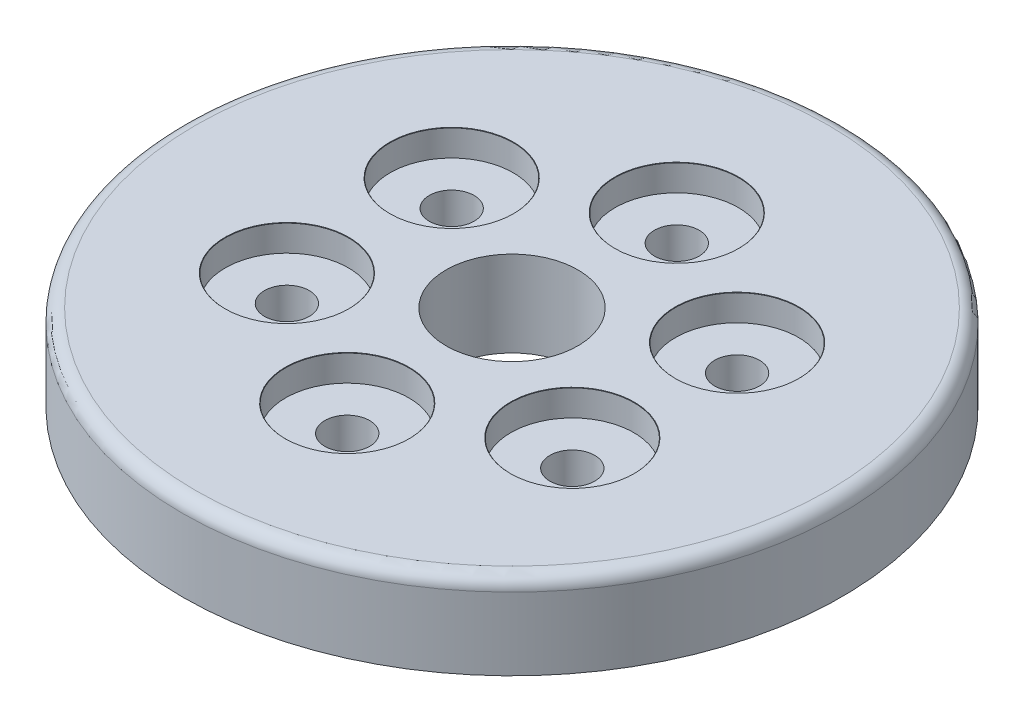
ISO-10303-21;
HEADER;
FILE_DESCRIPTION(('STEP AP214'),'2;1');
FILE_NAME('part.step','',(''),(''),'','','');
FILE_SCHEMA(('AUTOMOTIVE_DESIGN { 1 0 10303 214 1 1 1 1 }'));
ENDSEC;
DATA;
#1=APPLICATION_CONTEXT('core data for automotive mechanical design processes');
#2=APPLICATION_PROTOCOL_DEFINITION('international standard','automotive_design',2000,#1);
#3=PRODUCT_CONTEXT('',#1,'mechanical');
#4=PRODUCT('Part','Part','',(#3));
#5=PRODUCT_RELATED_PRODUCT_CATEGORY('part','',(#4));
#6=PRODUCT_DEFINITION_FORMATION('','',#4);
#7=PRODUCT_DEFINITION_CONTEXT('part definition',#1,'design');
#8=PRODUCT_DEFINITION('design','',#6,#7);
#9=PRODUCT_DEFINITION_SHAPE('','',#8);
#10=(LENGTH_UNIT() NAMED_UNIT(*) SI_UNIT(.MILLI.,.METRE.));
#11=(NAMED_UNIT(*) PLANE_ANGLE_UNIT() SI_UNIT($,.RADIAN.));
#12=(NAMED_UNIT(*) SI_UNIT($,.STERADIAN.) SOLID_ANGLE_UNIT());
#13=UNCERTAINTY_MEASURE_WITH_UNIT(LENGTH_MEASURE(1.E-05),#10,'distance_accuracy_value','');
#14=(GEOMETRIC_REPRESENTATION_CONTEXT(3) GLOBAL_UNCERTAINTY_ASSIGNED_CONTEXT((#13)) GLOBAL_UNIT_ASSIGNED_CONTEXT((#10,
#11,#12)) REPRESENTATION_CONTEXT('',''));
#15=CARTESIAN_POINT('',(0.,0.,0.));
#16=DIRECTION('',(0.,0.,1.));
#17=DIRECTION('',(1.,0.,0.));
#18=AXIS2_PLACEMENT_3D('',#15,#16,#17);
#19=CARTESIAN_POINT('',(0.,6.5,0.));
#20=DIRECTION('',(0.,-1.,0.));
#21=DIRECTION('',(0.,0.,-1.));
#22=AXIS2_PLACEMENT_3D('',#19,#20,#21);
#23=CYLINDRICAL_SURFACE('',#22,25.);
#24=CARTESIAN_POINT('',(0.,5.5,0.));
#25=DIRECTION('',(0.,1.,0.));
#26=DIRECTION('',(0.,0.,1.));
#27=AXIS2_PLACEMENT_3D('',#24,#25,#26);
#28=CIRCLE('',#27,25.);
#29=CARTESIAN_POINT('',(0.,5.5,-25.));
#30=VERTEX_POINT('',#29);
#31=EDGE_CURVE('E10',#30,#30,#28,.F.);
#32=CARTESIAN_POINT('',(0.,0.,0.));
#33=DIRECTION('',(0.,1.,0.));
#34=DIRECTION('',(0.,0.,1.));
#35=AXIS2_PLACEMENT_3D('',#32,#33,#34);
#36=CIRCLE('',#35,25.);
#37=CARTESIAN_POINT('',(0.,0.,-25.));
#38=VERTEX_POINT('',#37);
#39=EDGE_CURVE('E59',#38,#38,#36,.T.);
#40=CARTESIAN_POINT('',(0.,5.5,-25.));
#41=CARTESIAN_POINT('',(0.,5.44270833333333,-25.));
#42=CARTESIAN_POINT('',(0.,5.38541666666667,-25.));
#43=CARTESIAN_POINT('',(0.,5.27083333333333,-25.));
#44=CARTESIAN_POINT('',(0.,5.21354166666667,-25.));
#45=CARTESIAN_POINT('',(0.,5.09895833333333,-25.));
#46=CARTESIAN_POINT('',(0.,5.04166666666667,-25.));
#47=CARTESIAN_POINT('',(0.,4.92708333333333,-25.));
#48=CARTESIAN_POINT('',(0.,4.86979166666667,-25.));
#49=CARTESIAN_POINT('',(0.,4.75520833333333,-25.));
#50=CARTESIAN_POINT('',(0.,4.69791666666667,-25.));
#51=CARTESIAN_POINT('',(0.,4.58333333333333,-25.));
#52=CARTESIAN_POINT('',(0.,4.52604166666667,-25.));
#53=CARTESIAN_POINT('',(0.,4.41145833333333,-25.));
#54=CARTESIAN_POINT('',(0.,4.35416666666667,-25.));
#55=CARTESIAN_POINT('',(0.,4.23958333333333,-25.));
#56=CARTESIAN_POINT('',(0.,4.18229166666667,-25.));
#57=CARTESIAN_POINT('',(0.,4.06770833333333,-25.));
#58=CARTESIAN_POINT('',(0.,4.01041666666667,-25.));
#59=CARTESIAN_POINT('',(0.,3.89583333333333,-25.));
#60=CARTESIAN_POINT('',(0.,3.83854166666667,-25.));
#61=CARTESIAN_POINT('',(0.,3.72395833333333,-25.));
#62=CARTESIAN_POINT('',(0.,3.66666666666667,-25.));
#63=CARTESIAN_POINT('',(0.,3.55208333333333,-25.));
#64=CARTESIAN_POINT('',(0.,3.49479166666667,-25.));
#65=CARTESIAN_POINT('',(0.,3.38020833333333,-25.));
#66=CARTESIAN_POINT('',(0.,3.32291666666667,-25.));
#67=CARTESIAN_POINT('',(0.,3.20833333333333,-25.));
#68=CARTESIAN_POINT('',(0.,3.15104166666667,-25.));
#69=CARTESIAN_POINT('',(0.,3.03645833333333,-25.));
#70=CARTESIAN_POINT('',(0.,2.97916666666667,-25.));
#71=CARTESIAN_POINT('',(0.,2.86458333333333,-25.));
#72=CARTESIAN_POINT('',(0.,2.80729166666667,-25.));
#73=CARTESIAN_POINT('',(0.,2.69270833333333,-25.));
#74=CARTESIAN_POINT('',(0.,2.63541666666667,-25.));
#75=CARTESIAN_POINT('',(0.,2.52083333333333,-25.));
#76=CARTESIAN_POINT('',(0.,2.46354166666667,-25.));
#77=CARTESIAN_POINT('',(0.,2.34895833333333,-25.));
#78=CARTESIAN_POINT('',(0.,2.29166666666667,-25.));
#79=CARTESIAN_POINT('',(0.,2.17708333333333,-25.));
#80=CARTESIAN_POINT('',(0.,2.11979166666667,-25.));
#81=CARTESIAN_POINT('',(0.,2.00520833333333,-25.));
#82=CARTESIAN_POINT('',(0.,1.94791666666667,-25.));
#83=CARTESIAN_POINT('',(0.,1.83333333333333,-25.));
#84=CARTESIAN_POINT('',(0.,1.77604166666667,-25.));
#85=CARTESIAN_POINT('',(0.,1.66145833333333,-25.));
#86=CARTESIAN_POINT('',(0.,1.60416666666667,-25.));
#87=CARTESIAN_POINT('',(0.,1.48958333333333,-25.));
#88=CARTESIAN_POINT('',(0.,1.43229166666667,-25.));
#89=CARTESIAN_POINT('',(0.,1.31770833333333,-25.));
#90=CARTESIAN_POINT('',(0.,1.26041666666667,-25.));
#91=CARTESIAN_POINT('',(0.,1.14583333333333,-25.));
#92=CARTESIAN_POINT('',(0.,1.08854166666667,-25.));
#93=CARTESIAN_POINT('',(0.,0.973958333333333,-25.));
#94=CARTESIAN_POINT('',(0.,0.916666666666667,-25.));
#95=CARTESIAN_POINT('',(0.,0.802083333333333,-25.));
#96=CARTESIAN_POINT('',(0.,0.744791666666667,-25.));
#97=CARTESIAN_POINT('',(0.,0.630208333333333,-25.));
#98=CARTESIAN_POINT('',(0.,0.572916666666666,-25.));
#99=CARTESIAN_POINT('',(0.,0.458333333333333,-25.));
#100=CARTESIAN_POINT('',(0.,0.401041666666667,-25.));
#101=CARTESIAN_POINT('',(0.,0.286458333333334,-25.));
#102=CARTESIAN_POINT('',(0.,0.229166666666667,-25.));
#103=CARTESIAN_POINT('',(0.,0.114583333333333,-25.));
#104=CARTESIAN_POINT('',(0.,0.0572916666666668,-25.));
#105=CARTESIAN_POINT('',(0.,0.,-25.));
#106=B_SPLINE_CURVE_WITH_KNOTS('',3,(#40,#41,#42,#43,#44,#45,#46,#47,#48,#49,#50,#51,#52,#53,
#54,#55,#56,#57,#58,#59,#60,#61,#62,#63,#64,#65,#66,#67,#68,#69,#70,#71,#72,#73,#74,#75,#76,#77,
#78,#79,#80,#81,#82,#83,#84,#85,#86,#87,#88,#89,#90,#91,#92,#93,#94,#95,#96,#97,#98,#99,#100,
#101,#102,#103,#104,#105),.UNSPECIFIED.,.F.,.F.,(4,2,2,2,2,2,2,2,2,2,2,2,2,2,2,2,2,2,2,2,2,2,2,
2,2,2,2,2,2,2,2,2,4),(0.,0.171874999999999,0.343749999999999,0.515625,0.6875,0.859375,1.03125,
1.203125,1.375,1.546875,1.71875,1.890625,2.0625,2.234375,2.40625,2.578125,2.75,2.921875,3.09375,
3.265625,3.4375,3.609375,3.78125,3.953125,4.125,4.296875,4.46875,4.640625,4.8125,4.984375,
5.15625,5.328125,5.5),.UNSPECIFIED.);
#107=EDGE_CURVE('BSEAM45',#30,#38,#106,.T.);
#108=ORIENTED_EDGE('',*,*,#31,.T.);
#109=ORIENTED_EDGE('',*,*,#39,.T.);
#110=ORIENTED_EDGE('',*,*,#107,.T.);
#111=ORIENTED_EDGE('',*,*,#107,.F.);
#112=EDGE_LOOP('',(#108,#110,#109,#111));
#113=FACE_BOUND('',#112,.T.);
#114=ADVANCED_FACE('F45',(#113),#23,.T.);
#115=CARTESIAN_POINT('',(0.,6.5,0.));
#116=DIRECTION('',(0.,1.,0.));
#117=DIRECTION('',(0.,0.,1.));
#118=AXIS2_PLACEMENT_3D('',#115,#116,#117);
#119=PLANE('',#118);
#120=CARTESIAN_POINT('',(0.,6.5,0.));
#121=DIRECTION('',(0.,1.,0.));
#122=DIRECTION('',(0.,0.,1.));
#123=AXIS2_PLACEMENT_3D('',#120,#121,#122);
#124=CIRCLE('',#123,5.);
#125=CARTESIAN_POINT('',(0.,6.5,5.));
#126=VERTEX_POINT('',#125);
#127=EDGE_CURVE('E185',#126,#126,#124,.T.);
#128=ORIENTED_EDGE('',*,*,#127,.F.);
#129=EDGE_LOOP('',(#128));
#130=FACE_BOUND('',#129,.T.);
#131=CARTESIAN_POINT('',(0.,6.5,0.));
#132=DIRECTION('',(0.,1.,0.));
#133=DIRECTION('',(0.,0.,1.));
#134=AXIS2_PLACEMENT_3D('',#131,#132,#133);
#135=CIRCLE('',#134,24.);
#136=CARTESIAN_POINT('',(0.,6.5,24.));
#137=VERTEX_POINT('',#136);
#138=EDGE_CURVE('E54',#137,#137,#135,.T.);
#139=ORIENTED_EDGE('',*,*,#138,.T.);
#140=EDGE_LOOP('',(#139));
#141=FACE_BOUND('',#140,.T.);
#142=CARTESIAN_POINT('',(0.,6.5,-12.5));
#143=DIRECTION('',(0.,1.,0.));
#144=DIRECTION('',(0.,0.,1.));
#145=AXIS2_PLACEMENT_3D('',#142,#143,#144);
#146=CIRCLE('',#145,4.7005);
#147=CARTESIAN_POINT('',(0.,6.5,-7.7995));
#148=VERTEX_POINT('',#147);
#149=EDGE_CURVE('E181',#148,#148,#146,.T.);
#150=ORIENTED_EDGE('',*,*,#149,.F.);
#151=EDGE_LOOP('',(#150));
#152=FACE_BOUND('',#151,.T.);
#153=CARTESIAN_POINT('',(10.8253175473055,6.5,-6.24999999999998));
#154=DIRECTION('',(0.,1.,0.));
#155=DIRECTION('',(0.,0.,1.));
#156=AXIS2_PLACEMENT_3D('',#153,#154,#155);
#157=CIRCLE('',#156,4.7005);
#158=CARTESIAN_POINT('',(10.8253175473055,6.5,-1.54949999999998));
#159=VERTEX_POINT('',#158);
#160=EDGE_CURVE('E161',#159,#159,#157,.T.);
#161=ORIENTED_EDGE('',*,*,#160,.F.);
#162=EDGE_LOOP('',(#161));
#163=FACE_BOUND('',#162,.T.);
#164=CARTESIAN_POINT('',(10.8253175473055,6.5,6.25000000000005));
#165=DIRECTION('',(0.,1.,0.));
#166=DIRECTION('',(0.,0.,1.));
#167=AXIS2_PLACEMENT_3D('',#164,#165,#166);
#168=CIRCLE('',#167,4.7005);
#169=CARTESIAN_POINT('',(10.8253175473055,6.5,10.9505000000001));
#170=VERTEX_POINT('',#169);
#171=EDGE_CURVE('E141',#170,#170,#168,.T.);
#172=ORIENTED_EDGE('',*,*,#171,.F.);
#173=EDGE_LOOP('',(#172));
#174=FACE_BOUND('',#173,.T.);
#175=CARTESIAN_POINT('',(0.,6.5,12.5));
#176=DIRECTION('',(0.,1.,0.));
#177=DIRECTION('',(0.,0.,1.));
#178=AXIS2_PLACEMENT_3D('',#175,#176,#177);
#179=CIRCLE('',#178,4.7005);
#180=CARTESIAN_POINT('',(0.,6.5,17.2005));
#181=VERTEX_POINT('',#180);
#182=EDGE_CURVE('E121',#181,#181,#179,.T.);
#183=ORIENTED_EDGE('',*,*,#182,.F.);
#184=EDGE_LOOP('',(#183));
#185=FACE_BOUND('',#184,.T.);
#186=CARTESIAN_POINT('',(-10.8253175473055,6.5,6.2499999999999));
#187=DIRECTION('',(0.,1.,0.));
#188=DIRECTION('',(0.,0.,1.));
#189=AXIS2_PLACEMENT_3D('',#186,#187,#188);
#190=CIRCLE('',#189,4.7005);
#191=CARTESIAN_POINT('',(-10.8253175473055,6.5,10.9504999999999));
#192=VERTEX_POINT('',#191);
#193=EDGE_CURVE('E101',#192,#192,#190,.T.);
#194=ORIENTED_EDGE('',*,*,#193,.F.);
#195=EDGE_LOOP('',(#194));
#196=FACE_BOUND('',#195,.T.);
#197=CARTESIAN_POINT('',(-10.8253175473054,6.5,-6.25000000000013));
#198=DIRECTION('',(0.,1.,0.));
#199=DIRECTION('',(0.,0.,1.));
#200=AXIS2_PLACEMENT_3D('',#197,#198,#199);
#201=CIRCLE('',#200,4.7005);
#202=CARTESIAN_POINT('',(-10.8253175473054,6.5,-1.54950000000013));
#203=VERTEX_POINT('',#202);
#204=EDGE_CURVE('E81',#203,#203,#201,.T.);
#205=ORIENTED_EDGE('',*,*,#204,.F.);
#206=EDGE_LOOP('',(#205));
#207=FACE_BOUND('',#206,.T.);
#208=ADVANCED_FACE('F208',(#130,#141,#152,#163,#174,#185,#196,#207),#119,.T.);
#209=CARTESIAN_POINT('',(0.,0.,0.));
#210=DIRECTION('',(0.,1.,0.));
#211=DIRECTION('',(0.,0.,1.));
#212=AXIS2_PLACEMENT_3D('',#209,#210,#211);
#213=PLANE('',#212);
#214=CARTESIAN_POINT('',(0.,0.,0.));
#215=DIRECTION('',(0.,1.,0.));
#216=DIRECTION('',(0.,0.,1.));
#217=AXIS2_PLACEMENT_3D('',#214,#215,#216);
#218=CIRCLE('',#217,5.);
#219=CARTESIAN_POINT('',(0.,0.,5.));
#220=VERTEX_POINT('',#219);
#221=EDGE_CURVE('E49',#220,#220,#218,.T.);
#222=ORIENTED_EDGE('',*,*,#221,.T.);
#223=EDGE_LOOP('',(#222));
#224=FACE_BOUND('',#223,.T.);
#225=CARTESIAN_POINT('',(0.,0.,-12.5));
#226=DIRECTION('',(0.,1.,0.));
#227=DIRECTION('',(0.,0.,1.));
#228=AXIS2_PLACEMENT_3D('',#225,#226,#227);
#229=CIRCLE('',#228,1.7);
#230=CARTESIAN_POINT('',(0.,0.,-10.8));
#231=VERTEX_POINT('',#230);
#232=EDGE_CURVE('E165',#231,#231,#229,.T.);
#233=ORIENTED_EDGE('',*,*,#232,.T.);
#234=EDGE_LOOP('',(#233));
#235=FACE_BOUND('',#234,.T.);
#236=CARTESIAN_POINT('',(10.8253175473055,0.,-6.24999999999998));
#237=DIRECTION('',(0.,1.,0.));
#238=DIRECTION('',(0.,0.,1.));
#239=AXIS2_PLACEMENT_3D('',#236,#237,#238);
#240=CIRCLE('',#239,1.7);
#241=CARTESIAN_POINT('',(10.8253175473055,0.,-4.54999999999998));
#242=VERTEX_POINT('',#241);
#243=EDGE_CURVE('E145',#242,#242,#240,.T.);
#244=ORIENTED_EDGE('',*,*,#243,.T.);
#245=EDGE_LOOP('',(#244));
#246=FACE_BOUND('',#245,.T.);
#247=CARTESIAN_POINT('',(10.8253175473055,0.,6.25000000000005));
#248=DIRECTION('',(0.,1.,0.));
#249=DIRECTION('',(0.,0.,1.));
#250=AXIS2_PLACEMENT_3D('',#247,#248,#249);
#251=CIRCLE('',#250,1.7);
#252=CARTESIAN_POINT('',(10.8253175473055,0.,7.95000000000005));
#253=VERTEX_POINT('',#252);
#254=EDGE_CURVE('E125',#253,#253,#251,.T.);
#255=ORIENTED_EDGE('',*,*,#254,.T.);
#256=EDGE_LOOP('',(#255));
#257=FACE_BOUND('',#256,.T.);
#258=CARTESIAN_POINT('',(0.,0.,12.5));
#259=DIRECTION('',(0.,1.,0.));
#260=DIRECTION('',(0.,0.,1.));
#261=AXIS2_PLACEMENT_3D('',#258,#259,#260);
#262=CIRCLE('',#261,1.7);
#263=CARTESIAN_POINT('',(0.,0.,14.2));
#264=VERTEX_POINT('',#263);
#265=EDGE_CURVE('E105',#264,#264,#262,.T.);
#266=ORIENTED_EDGE('',*,*,#265,.T.);
#267=EDGE_LOOP('',(#266));
#268=FACE_BOUND('',#267,.T.);
#269=CARTESIAN_POINT('',(-10.8253175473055,0.,6.2499999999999));
#270=DIRECTION('',(0.,1.,0.));
#271=DIRECTION('',(0.,0.,1.));
#272=AXIS2_PLACEMENT_3D('',#269,#270,#271);
#273=CIRCLE('',#272,1.7);
#274=CARTESIAN_POINT('',(-10.8253175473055,0.,7.9499999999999));
#275=VERTEX_POINT('',#274);
#276=EDGE_CURVE('E85',#275,#275,#273,.T.);
#277=ORIENTED_EDGE('',*,*,#276,.T.);
#278=EDGE_LOOP('',(#277));
#279=FACE_BOUND('',#278,.T.);
#280=CARTESIAN_POINT('',(-10.8253175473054,0.,-6.25000000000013));
#281=DIRECTION('',(0.,1.,0.));
#282=DIRECTION('',(0.,0.,1.));
#283=AXIS2_PLACEMENT_3D('',#280,#281,#282);
#284=CIRCLE('',#283,1.7);
#285=CARTESIAN_POINT('',(-10.8253175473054,0.,-4.55000000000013));
#286=VERTEX_POINT('',#285);
#287=EDGE_CURVE('E65',#286,#286,#284,.T.);
#288=ORIENTED_EDGE('',*,*,#287,.T.);
#289=EDGE_LOOP('',(#288));
#290=FACE_BOUND('',#289,.T.);
#291=ORIENTED_EDGE('',*,*,#39,.F.);
#292=EDGE_LOOP('',(#291));
#293=FACE_BOUND('',#292,.T.);
#294=ADVANCED_FACE('F194',(#224,#235,#246,#257,#268,#279,#290,#293),#213,.F.);
#295=CARTESIAN_POINT('',(-10.8253175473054,6.5,-6.25000000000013));
#296=DIRECTION('',(0.,1.,0.));
#297=DIRECTION('',(0.,0.,1.));
#298=AXIS2_PLACEMENT_3D('',#295,#296,#297);
#299=CYLINDRICAL_SURFACE('',#298,1.7);
#300=ORIENTED_EDGE('',*,*,#287,.F.);
#301=EDGE_LOOP('',(#300));
#302=FACE_BOUND('',#301,.T.);
#303=CARTESIAN_POINT('',(-10.8253175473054,4.5,-6.25000000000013));
#304=DIRECTION('',(0.,1.,0.));
#305=DIRECTION('',(0.,0.,1.));
#306=AXIS2_PLACEMENT_3D('',#303,#304,#305);
#307=CIRCLE('',#306,1.7);
#308=CARTESIAN_POINT('',(-10.8253175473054,4.5,-4.55000000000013));
#309=VERTEX_POINT('',#308);
#310=EDGE_CURVE('E69',#309,#309,#307,.T.);
#311=ORIENTED_EDGE('',*,*,#310,.T.);
#312=EDGE_LOOP('',(#311));
#313=FACE_BOUND('',#312,.T.);
#314=ADVANCED_FACE('F217',(#302,#313),#299,.F.);
#315=CARTESIAN_POINT('',(-6.14981754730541,4.5,-6.25000000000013));
#316=DIRECTION('',(0.,-1.,0.));
#317=DIRECTION('',(0.,0.,-1.));
#318=AXIS2_PLACEMENT_3D('',#315,#316,#317);
#319=PLANE('',#318);
#320=ORIENTED_EDGE('',*,*,#310,.F.);
#321=EDGE_LOOP('',(#320));
#322=FACE_BOUND('',#321,.T.);
#323=CARTESIAN_POINT('',(-10.8253175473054,4.5,-6.25000000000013));
#324=DIRECTION('',(0.,1.,0.));
#325=DIRECTION('',(0.,0.,1.));
#326=AXIS2_PLACEMENT_3D('',#323,#324,#325);
#327=CIRCLE('',#326,4.6755);
#328=CARTESIAN_POINT('',(-10.8253175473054,4.5,-1.57450000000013));
#329=VERTEX_POINT('',#328);
#330=EDGE_CURVE('E73',#329,#329,#327,.T.);
#331=ORIENTED_EDGE('',*,*,#330,.T.);
#332=EDGE_LOOP('',(#331));
#333=FACE_BOUND('',#332,.T.);
#334=ADVANCED_FACE('F221',(#322,#333),#319,.F.);
#335=CARTESIAN_POINT('',(-10.8253175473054,6.5,-6.25000000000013));
#336=DIRECTION('',(0.,1.,0.));
#337=DIRECTION('',(0.,0.,1.));
#338=AXIS2_PLACEMENT_3D('',#335,#336,#337);
#339=CYLINDRICAL_SURFACE('',#338,4.6755);
#340=ORIENTED_EDGE('',*,*,#330,.F.);
#341=EDGE_LOOP('',(#340));
#342=FACE_BOUND('',#341,.T.);
#343=CARTESIAN_POINT('',(-10.8253175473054,6.475,-6.25000000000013));
#344=DIRECTION('',(0.,1.,0.));
#345=DIRECTION('',(0.,0.,1.));
#346=AXIS2_PLACEMENT_3D('',#343,#344,#345);
#347=CIRCLE('',#346,4.6755);
#348=CARTESIAN_POINT('',(-10.8253175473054,6.475,-1.57450000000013));
#349=VERTEX_POINT('',#348);
#350=EDGE_CURVE('E77',#349,#349,#347,.T.);
#351=ORIENTED_EDGE('',*,*,#350,.T.);
#352=EDGE_LOOP('',(#351));
#353=FACE_BOUND('',#352,.T.);
#354=ADVANCED_FACE('F225',(#342,#353),#339,.F.);
#355=CARTESIAN_POINT('',(-10.8253175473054,6.5,-6.25000000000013));
#356=DIRECTION('',(0.,1.,0.));
#357=DIRECTION('',(0.,0.,1.));
#358=AXIS2_PLACEMENT_3D('',#355,#356,#357);
#359=CONICAL_SURFACE('',#358,4.7005,0.785398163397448);
#360=ORIENTED_EDGE('',*,*,#350,.F.);
#361=EDGE_LOOP('',(#360));
#362=FACE_BOUND('',#361,.T.);
#363=ORIENTED_EDGE('',*,*,#204,.T.);
#364=EDGE_LOOP('',(#363));
#365=FACE_BOUND('',#364,.T.);
#366=ADVANCED_FACE('F229',(#362,#365),#359,.F.);
#367=CARTESIAN_POINT('',(-10.8253175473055,6.5,6.2499999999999));
#368=DIRECTION('',(0.,1.,0.));
#369=DIRECTION('',(0.,0.,1.));
#370=AXIS2_PLACEMENT_3D('',#367,#368,#369);
#371=CYLINDRICAL_SURFACE('',#370,1.7);
#372=ORIENTED_EDGE('',*,*,#276,.F.);
#373=EDGE_LOOP('',(#372));
#374=FACE_BOUND('',#373,.T.);
#375=CARTESIAN_POINT('',(-10.8253175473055,4.5,6.2499999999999));
#376=DIRECTION('',(0.,1.,0.));
#377=DIRECTION('',(0.,0.,1.));
#378=AXIS2_PLACEMENT_3D('',#375,#376,#377);
#379=CIRCLE('',#378,1.7);
#380=CARTESIAN_POINT('',(-10.8253175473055,4.5,7.9499999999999));
#381=VERTEX_POINT('',#380);
#382=EDGE_CURVE('E89',#381,#381,#379,.T.);
#383=ORIENTED_EDGE('',*,*,#382,.T.);
#384=EDGE_LOOP('',(#383));
#385=FACE_BOUND('',#384,.T.);
#386=ADVANCED_FACE('F233',(#374,#385),#371,.F.);
#387=CARTESIAN_POINT('',(-6.14981754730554,4.5,6.2499999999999));
#388=DIRECTION('',(0.,-1.,0.));
#389=DIRECTION('',(0.,0.,-1.));
#390=AXIS2_PLACEMENT_3D('',#387,#388,#389);
#391=PLANE('',#390);
#392=ORIENTED_EDGE('',*,*,#382,.F.);
#393=EDGE_LOOP('',(#392));
#394=FACE_BOUND('',#393,.T.);
#395=CARTESIAN_POINT('',(-10.8253175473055,4.5,6.2499999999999));
#396=DIRECTION('',(0.,1.,0.));
#397=DIRECTION('',(0.,0.,1.));
#398=AXIS2_PLACEMENT_3D('',#395,#396,#397);
#399=CIRCLE('',#398,4.6755);
#400=CARTESIAN_POINT('',(-10.8253175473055,4.5,10.9254999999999));
#401=VERTEX_POINT('',#400);
#402=EDGE_CURVE('E93',#401,#401,#399,.T.);
#403=ORIENTED_EDGE('',*,*,#402,.T.);
#404=EDGE_LOOP('',(#403));
#405=FACE_BOUND('',#404,.T.);
#406=ADVANCED_FACE('F237',(#394,#405),#391,.F.);
#407=CARTESIAN_POINT('',(-10.8253175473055,6.5,6.2499999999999));
#408=DIRECTION('',(0.,1.,0.));
#409=DIRECTION('',(0.,0.,1.));
#410=AXIS2_PLACEMENT_3D('',#407,#408,#409);
#411=CYLINDRICAL_SURFACE('',#410,4.6755);
#412=ORIENTED_EDGE('',*,*,#402,.F.);
#413=EDGE_LOOP('',(#412));
#414=FACE_BOUND('',#413,.T.);
#415=CARTESIAN_POINT('',(-10.8253175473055,6.475,6.2499999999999));
#416=DIRECTION('',(0.,1.,0.));
#417=DIRECTION('',(0.,0.,1.));
#418=AXIS2_PLACEMENT_3D('',#415,#416,#417);
#419=CIRCLE('',#418,4.6755);
#420=CARTESIAN_POINT('',(-10.8253175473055,6.475,10.9254999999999));
#421=VERTEX_POINT('',#420);
#422=EDGE_CURVE('E97',#421,#421,#419,.T.);
#423=ORIENTED_EDGE('',*,*,#422,.T.);
#424=EDGE_LOOP('',(#423));
#425=FACE_BOUND('',#424,.T.);
#426=ADVANCED_FACE('F241',(#414,#425),#411,.F.);
#427=CARTESIAN_POINT('',(-10.8253175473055,6.5,6.2499999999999));
#428=DIRECTION('',(0.,1.,0.));
#429=DIRECTION('',(0.,0.,1.));
#430=AXIS2_PLACEMENT_3D('',#427,#428,#429);
#431=CONICAL_SURFACE('',#430,4.7005,0.785398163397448);
#432=ORIENTED_EDGE('',*,*,#422,.F.);
#433=EDGE_LOOP('',(#432));
#434=FACE_BOUND('',#433,.T.);
#435=ORIENTED_EDGE('',*,*,#193,.T.);
#436=EDGE_LOOP('',(#435));
#437=FACE_BOUND('',#436,.T.);
#438=ADVANCED_FACE('F245',(#434,#437),#431,.F.);
#439=CARTESIAN_POINT('',(0.,6.5,12.5));
#440=DIRECTION('',(0.,1.,0.));
#441=DIRECTION('',(0.,0.,1.));
#442=AXIS2_PLACEMENT_3D('',#439,#440,#441);
#443=CYLINDRICAL_SURFACE('',#442,1.7);
#444=ORIENTED_EDGE('',*,*,#265,.F.);
#445=EDGE_LOOP('',(#444));
#446=FACE_BOUND('',#445,.T.);
#447=CARTESIAN_POINT('',(0.,4.5,12.5));
#448=DIRECTION('',(0.,1.,0.));
#449=DIRECTION('',(0.,0.,1.));
#450=AXIS2_PLACEMENT_3D('',#447,#448,#449);
#451=CIRCLE('',#450,1.7);
#452=CARTESIAN_POINT('',(0.,4.5,14.2));
#453=VERTEX_POINT('',#452);
#454=EDGE_CURVE('E109',#453,#453,#451,.T.);
#455=ORIENTED_EDGE('',*,*,#454,.T.);
#456=EDGE_LOOP('',(#455));
#457=FACE_BOUND('',#456,.T.);
#458=ADVANCED_FACE('F249',(#446,#457),#443,.F.);
#459=CARTESIAN_POINT('',(4.67549999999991,4.5,12.5));
#460=DIRECTION('',(0.,-1.,0.));
#461=DIRECTION('',(0.,0.,-1.));
#462=AXIS2_PLACEMENT_3D('',#459,#460,#461);
#463=PLANE('',#462);
#464=ORIENTED_EDGE('',*,*,#454,.F.);
#465=EDGE_LOOP('',(#464));
#466=FACE_BOUND('',#465,.T.);
#467=CARTESIAN_POINT('',(0.,4.5,12.5));
#468=DIRECTION('',(0.,1.,0.));
#469=DIRECTION('',(0.,0.,1.));
#470=AXIS2_PLACEMENT_3D('',#467,#468,#469);
#471=CIRCLE('',#470,4.6755);
#472=CARTESIAN_POINT('',(0.,4.5,17.1755));
#473=VERTEX_POINT('',#472);
#474=EDGE_CURVE('E113',#473,#473,#471,.T.);
#475=ORIENTED_EDGE('',*,*,#474,.T.);
#476=EDGE_LOOP('',(#475));
#477=FACE_BOUND('',#476,.T.);
#478=ADVANCED_FACE('F253',(#466,#477),#463,.F.);
#479=CARTESIAN_POINT('',(0.,6.5,12.5));
#480=DIRECTION('',(0.,1.,0.));
#481=DIRECTION('',(0.,0.,1.));
#482=AXIS2_PLACEMENT_3D('',#479,#480,#481);
#483=CYLINDRICAL_SURFACE('',#482,4.6755);
#484=ORIENTED_EDGE('',*,*,#474,.F.);
#485=EDGE_LOOP('',(#484));
#486=FACE_BOUND('',#485,.T.);
#487=CARTESIAN_POINT('',(0.,6.475,12.5));
#488=DIRECTION('',(0.,1.,0.));
#489=DIRECTION('',(0.,0.,1.));
#490=AXIS2_PLACEMENT_3D('',#487,#488,#489);
#491=CIRCLE('',#490,4.6755);
#492=CARTESIAN_POINT('',(0.,6.475,17.1755));
#493=VERTEX_POINT('',#492);
#494=EDGE_CURVE('E117',#493,#493,#491,.T.);
#495=ORIENTED_EDGE('',*,*,#494,.T.);
#496=EDGE_LOOP('',(#495));
#497=FACE_BOUND('',#496,.T.);
#498=ADVANCED_FACE('F257',(#486,#497),#483,.F.);
#499=CARTESIAN_POINT('',(0.,6.5,12.5));
#500=DIRECTION('',(0.,1.,0.));
#501=DIRECTION('',(0.,0.,1.));
#502=AXIS2_PLACEMENT_3D('',#499,#500,#501);
#503=CONICAL_SURFACE('',#502,4.7005,0.785398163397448);
#504=ORIENTED_EDGE('',*,*,#494,.F.);
#505=EDGE_LOOP('',(#504));
#506=FACE_BOUND('',#505,.T.);
#507=ORIENTED_EDGE('',*,*,#182,.T.);
#508=EDGE_LOOP('',(#507));
#509=FACE_BOUND('',#508,.T.);
#510=ADVANCED_FACE('F261',(#506,#509),#503,.F.);
#511=CARTESIAN_POINT('',(10.8253175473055,6.5,6.25000000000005));
#512=DIRECTION('',(0.,1.,0.));
#513=DIRECTION('',(0.,0.,1.));
#514=AXIS2_PLACEMENT_3D('',#511,#512,#513);
#515=CYLINDRICAL_SURFACE('',#514,1.7);
#516=ORIENTED_EDGE('',*,*,#254,.F.);
#517=EDGE_LOOP('',(#516));
#518=FACE_BOUND('',#517,.T.);
#519=CARTESIAN_POINT('',(10.8253175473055,4.5,6.25000000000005));
#520=DIRECTION('',(0.,1.,0.));
#521=DIRECTION('',(0.,0.,1.));
#522=AXIS2_PLACEMENT_3D('',#519,#520,#521);
#523=CIRCLE('',#522,1.7);
#524=CARTESIAN_POINT('',(10.8253175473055,4.5,7.95000000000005));
#525=VERTEX_POINT('',#524);
#526=EDGE_CURVE('E129',#525,#525,#523,.T.);
#527=ORIENTED_EDGE('',*,*,#526,.T.);
#528=EDGE_LOOP('',(#527));
#529=FACE_BOUND('',#528,.T.);
#530=ADVANCED_FACE('F265',(#518,#529),#515,.F.);
#531=CARTESIAN_POINT('',(15.5008175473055,4.5,6.25000000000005));
#532=DIRECTION('',(0.,-1.,0.));
#533=DIRECTION('',(0.,0.,-1.));
#534=AXIS2_PLACEMENT_3D('',#531,#532,#533);
#535=PLANE('',#534);
#536=ORIENTED_EDGE('',*,*,#526,.F.);
#537=EDGE_LOOP('',(#536));
#538=FACE_BOUND('',#537,.T.);
#539=CARTESIAN_POINT('',(10.8253175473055,4.5,6.25000000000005));
#540=DIRECTION('',(0.,1.,0.));
#541=DIRECTION('',(0.,0.,1.));
#542=AXIS2_PLACEMENT_3D('',#539,#540,#541);
#543=CIRCLE('',#542,4.6755);
#544=CARTESIAN_POINT('',(10.8253175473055,4.5,10.9255000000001));
#545=VERTEX_POINT('',#544);
#546=EDGE_CURVE('E133',#545,#545,#543,.T.);
#547=ORIENTED_EDGE('',*,*,#546,.T.);
#548=EDGE_LOOP('',(#547));
#549=FACE_BOUND('',#548,.T.);
#550=ADVANCED_FACE('F269',(#538,#549),#535,.F.);
#551=CARTESIAN_POINT('',(10.8253175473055,6.5,6.25000000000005));
#552=DIRECTION('',(0.,1.,0.));
#553=DIRECTION('',(0.,0.,1.));
#554=AXIS2_PLACEMENT_3D('',#551,#552,#553);
#555=CYLINDRICAL_SURFACE('',#554,4.6755);
#556=ORIENTED_EDGE('',*,*,#546,.F.);
#557=EDGE_LOOP('',(#556));
#558=FACE_BOUND('',#557,.T.);
#559=CARTESIAN_POINT('',(10.8253175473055,6.475,6.25000000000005));
#560=DIRECTION('',(0.,1.,0.));
#561=DIRECTION('',(0.,0.,1.));
#562=AXIS2_PLACEMENT_3D('',#559,#560,#561);
#563=CIRCLE('',#562,4.6755);
#564=CARTESIAN_POINT('',(10.8253175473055,6.475,10.9255000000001));
#565=VERTEX_POINT('',#564);
#566=EDGE_CURVE('E137',#565,#565,#563,.T.);
#567=ORIENTED_EDGE('',*,*,#566,.T.);
#568=EDGE_LOOP('',(#567));
#569=FACE_BOUND('',#568,.T.);
#570=ADVANCED_FACE('F273',(#558,#569),#555,.F.);
#571=CARTESIAN_POINT('',(10.8253175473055,6.5,6.25000000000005));
#572=DIRECTION('',(0.,1.,0.));
#573=DIRECTION('',(0.,0.,1.));
#574=AXIS2_PLACEMENT_3D('',#571,#572,#573);
#575=CONICAL_SURFACE('',#574,4.7005,0.785398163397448);
#576=ORIENTED_EDGE('',*,*,#566,.F.);
#577=EDGE_LOOP('',(#576));
#578=FACE_BOUND('',#577,.T.);
#579=ORIENTED_EDGE('',*,*,#171,.T.);
#580=EDGE_LOOP('',(#579));
#581=FACE_BOUND('',#580,.T.);
#582=ADVANCED_FACE('F277',(#578,#581),#575,.F.);
#583=CARTESIAN_POINT('',(10.8253175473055,6.5,-6.24999999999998));
#584=DIRECTION('',(0.,1.,0.));
#585=DIRECTION('',(0.,0.,1.));
#586=AXIS2_PLACEMENT_3D('',#583,#584,#585);
#587=CYLINDRICAL_SURFACE('',#586,1.7);
#588=ORIENTED_EDGE('',*,*,#243,.F.);
#589=EDGE_LOOP('',(#588));
#590=FACE_BOUND('',#589,.T.);
#591=CARTESIAN_POINT('',(10.8253175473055,4.5,-6.24999999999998));
#592=DIRECTION('',(0.,1.,0.));
#593=DIRECTION('',(0.,0.,1.));
#594=AXIS2_PLACEMENT_3D('',#591,#592,#593);
#595=CIRCLE('',#594,1.7);
#596=CARTESIAN_POINT('',(10.8253175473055,4.5,-4.54999999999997));
#597=VERTEX_POINT('',#596);
#598=EDGE_CURVE('E149',#597,#597,#595,.T.);
#599=ORIENTED_EDGE('',*,*,#598,.T.);
#600=EDGE_LOOP('',(#599));
#601=FACE_BOUND('',#600,.T.);
#602=ADVANCED_FACE('F281',(#590,#601),#587,.F.);
#603=CARTESIAN_POINT('',(15.5008175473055,4.5,-6.24999999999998));
#604=DIRECTION('',(0.,-1.,0.));
#605=DIRECTION('',(0.,0.,-1.));
#606=AXIS2_PLACEMENT_3D('',#603,#604,#605);
#607=PLANE('',#606);
#608=ORIENTED_EDGE('',*,*,#598,.F.);
#609=EDGE_LOOP('',(#608));
#610=FACE_BOUND('',#609,.T.);
#611=CARTESIAN_POINT('',(10.8253175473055,4.5,-6.24999999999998));
#612=DIRECTION('',(0.,1.,0.));
#613=DIRECTION('',(0.,0.,1.));
#614=AXIS2_PLACEMENT_3D('',#611,#612,#613);
#615=CIRCLE('',#614,4.6755);
#616=CARTESIAN_POINT('',(10.8253175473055,4.5,-1.57449999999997));
#617=VERTEX_POINT('',#616);
#618=EDGE_CURVE('E153',#617,#617,#615,.T.);
#619=ORIENTED_EDGE('',*,*,#618,.T.);
#620=EDGE_LOOP('',(#619));
#621=FACE_BOUND('',#620,.T.);
#622=ADVANCED_FACE('F285',(#610,#621),#607,.F.);
#623=CARTESIAN_POINT('',(10.8253175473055,6.5,-6.24999999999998));
#624=DIRECTION('',(0.,1.,0.));
#625=DIRECTION('',(0.,0.,1.));
#626=AXIS2_PLACEMENT_3D('',#623,#624,#625);
#627=CYLINDRICAL_SURFACE('',#626,4.6755);
#628=ORIENTED_EDGE('',*,*,#618,.F.);
#629=EDGE_LOOP('',(#628));
#630=FACE_BOUND('',#629,.T.);
#631=CARTESIAN_POINT('',(10.8253175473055,6.475,-6.24999999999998));
#632=DIRECTION('',(0.,1.,0.));
#633=DIRECTION('',(0.,0.,1.));
#634=AXIS2_PLACEMENT_3D('',#631,#632,#633);
#635=CIRCLE('',#634,4.6755);
#636=CARTESIAN_POINT('',(10.8253175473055,6.475,-1.57449999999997));
#637=VERTEX_POINT('',#636);
#638=EDGE_CURVE('E157',#637,#637,#635,.T.);
#639=ORIENTED_EDGE('',*,*,#638,.T.);
#640=EDGE_LOOP('',(#639));
#641=FACE_BOUND('',#640,.T.);
#642=ADVANCED_FACE('F289',(#630,#641),#627,.F.);
#643=CARTESIAN_POINT('',(10.8253175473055,6.5,-6.24999999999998));
#644=DIRECTION('',(0.,1.,0.));
#645=DIRECTION('',(0.,0.,1.));
#646=AXIS2_PLACEMENT_3D('',#643,#644,#645);
#647=CONICAL_SURFACE('',#646,4.7005,0.785398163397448);
#648=ORIENTED_EDGE('',*,*,#638,.F.);
#649=EDGE_LOOP('',(#648));
#650=FACE_BOUND('',#649,.T.);
#651=ORIENTED_EDGE('',*,*,#160,.T.);
#652=EDGE_LOOP('',(#651));
#653=FACE_BOUND('',#652,.T.);
#654=ADVANCED_FACE('F293',(#650,#653),#647,.F.);
#655=CARTESIAN_POINT('',(0.,6.5,-12.5));
#656=DIRECTION('',(0.,1.,0.));
#657=DIRECTION('',(0.,0.,1.));
#658=AXIS2_PLACEMENT_3D('',#655,#656,#657);
#659=CYLINDRICAL_SURFACE('',#658,1.7);
#660=ORIENTED_EDGE('',*,*,#232,.F.);
#661=EDGE_LOOP('',(#660));
#662=FACE_BOUND('',#661,.T.);
#663=CARTESIAN_POINT('',(0.,4.5,-12.5));
#664=DIRECTION('',(0.,1.,0.));
#665=DIRECTION('',(0.,0.,1.));
#666=AXIS2_PLACEMENT_3D('',#663,#664,#665);
#667=CIRCLE('',#666,1.7);
#668=CARTESIAN_POINT('',(0.,4.5,-10.8));
#669=VERTEX_POINT('',#668);
#670=EDGE_CURVE('E169',#669,#669,#667,.T.);
#671=ORIENTED_EDGE('',*,*,#670,.T.);
#672=EDGE_LOOP('',(#671));
#673=FACE_BOUND('',#672,.T.);
#674=ADVANCED_FACE('F297',(#662,#673),#659,.F.);
#675=CARTESIAN_POINT('',(4.6755,4.5,-12.5));
#676=DIRECTION('',(0.,-1.,0.));
#677=DIRECTION('',(0.,0.,-1.));
#678=AXIS2_PLACEMENT_3D('',#675,#676,#677);
#679=PLANE('',#678);
#680=ORIENTED_EDGE('',*,*,#670,.F.);
#681=EDGE_LOOP('',(#680));
#682=FACE_BOUND('',#681,.T.);
#683=CARTESIAN_POINT('',(0.,4.5,-12.5));
#684=DIRECTION('',(0.,1.,0.));
#685=DIRECTION('',(0.,0.,1.));
#686=AXIS2_PLACEMENT_3D('',#683,#684,#685);
#687=CIRCLE('',#686,4.6755);
#688=CARTESIAN_POINT('',(0.,4.5,-7.8245));
#689=VERTEX_POINT('',#688);
#690=EDGE_CURVE('E173',#689,#689,#687,.T.);
#691=ORIENTED_EDGE('',*,*,#690,.T.);
#692=EDGE_LOOP('',(#691));
#693=FACE_BOUND('',#692,.T.);
#694=ADVANCED_FACE('F301',(#682,#693),#679,.F.);
#695=CARTESIAN_POINT('',(0.,6.5,-12.5));
#696=DIRECTION('',(0.,1.,0.));
#697=DIRECTION('',(0.,0.,1.));
#698=AXIS2_PLACEMENT_3D('',#695,#696,#697);
#699=CYLINDRICAL_SURFACE('',#698,4.6755);
#700=ORIENTED_EDGE('',*,*,#690,.F.);
#701=EDGE_LOOP('',(#700));
#702=FACE_BOUND('',#701,.T.);
#703=CARTESIAN_POINT('',(0.,6.475,-12.5));
#704=DIRECTION('',(0.,1.,0.));
#705=DIRECTION('',(0.,0.,1.));
#706=AXIS2_PLACEMENT_3D('',#703,#704,#705);
#707=CIRCLE('',#706,4.6755);
#708=CARTESIAN_POINT('',(0.,6.475,-7.8245));
#709=VERTEX_POINT('',#708);
#710=EDGE_CURVE('E177',#709,#709,#707,.T.);
#711=ORIENTED_EDGE('',*,*,#710,.T.);
#712=EDGE_LOOP('',(#711));
#713=FACE_BOUND('',#712,.T.);
#714=ADVANCED_FACE('F305',(#702,#713),#699,.F.);
#715=CARTESIAN_POINT('',(0.,6.5,-12.5));
#716=DIRECTION('',(0.,1.,0.));
#717=DIRECTION('',(0.,0.,1.));
#718=AXIS2_PLACEMENT_3D('',#715,#716,#717);
#719=CONICAL_SURFACE('',#718,4.7005,0.785398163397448);
#720=ORIENTED_EDGE('',*,*,#710,.F.);
#721=EDGE_LOOP('',(#720));
#722=FACE_BOUND('',#721,.T.);
#723=ORIENTED_EDGE('',*,*,#149,.T.);
#724=EDGE_LOOP('',(#723));
#725=FACE_BOUND('',#724,.T.);
#726=ADVANCED_FACE('F204',(#722,#725),#719,.F.);
#727=CARTESIAN_POINT('',(0.,5.5,0.));
#728=DIRECTION('',(0.,1.,0.));
#729=DIRECTION('',(0.,0.,1.));
#730=AXIS2_PLACEMENT_3D('',#727,#728,#729);
#731=TOROIDAL_SURFACE('',#730,24.,1.);
#732=ORIENTED_EDGE('',*,*,#31,.F.);
#733=EDGE_LOOP('',(#732));
#734=FACE_BOUND('',#733,.T.);
#735=ORIENTED_EDGE('',*,*,#138,.F.);
#736=EDGE_LOOP('',(#735));
#737=FACE_BOUND('',#736,.T.);
#738=ADVANCED_FACE('F47',(#734,#737),#731,.T.);
#739=CARTESIAN_POINT('',(0.,-14.2,0.));
#740=DIRECTION('',(0.,1.,0.));
#741=DIRECTION('',(0.,0.,1.));
#742=AXIS2_PLACEMENT_3D('',#739,#740,#741);
#743=CYLINDRICAL_SURFACE('',#742,5.);
#744=ORIENTED_EDGE('',*,*,#127,.T.);
#745=EDGE_LOOP('',(#744));
#746=FACE_BOUND('',#745,.T.);
#747=ORIENTED_EDGE('',*,*,#221,.F.);
#748=EDGE_LOOP('',(#747));
#749=FACE_BOUND('',#748,.T.);
#750=ADVANCED_FACE('F197',(#746,#749),#743,.F.);
#751=CLOSED_SHELL('',(#114,#208,#294,#314,#334,#354,#366,#386,#406,#426,#438,#458,#478,#498,
#510,#530,#550,#570,#582,#602,#622,#642,#654,#674,#694,#714,#726,#738,#750));
#752=MANIFOLD_SOLID_BREP('B2',#751);
#753=ADVANCED_BREP_SHAPE_REPRESENTATION('',(#18,#752),#14);
#754=SHAPE_DEFINITION_REPRESENTATION(#9,#753);
ENDSEC;
END-ISO-10303-21;
